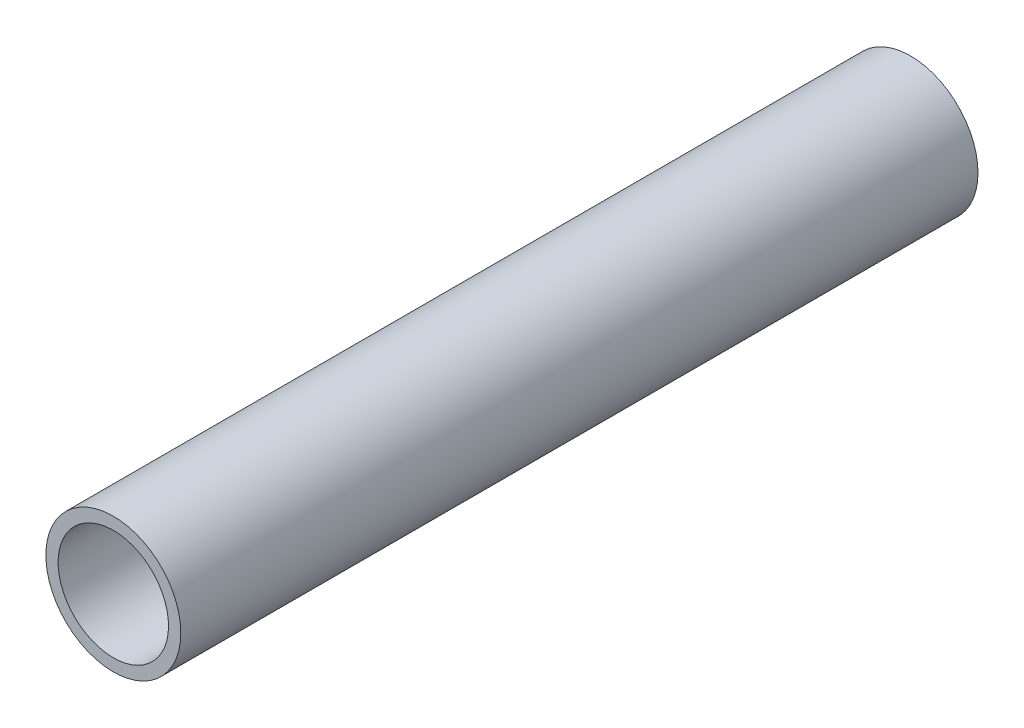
ISO-10303-21;
HEADER;
FILE_DESCRIPTION(('STEP AP214'),'2;1');
FILE_NAME('part.step','',(''),(''),'','','');
FILE_SCHEMA(('AUTOMOTIVE_DESIGN { 1 0 10303 214 1 1 1 1 }'));
ENDSEC;
DATA;
#1=APPLICATION_CONTEXT('core data for automotive mechanical design processes');
#2=APPLICATION_PROTOCOL_DEFINITION('international standard','automotive_design',2000,#1);
#3=PRODUCT_CONTEXT('',#1,'mechanical');
#4=PRODUCT('Part','Part','',(#3));
#5=PRODUCT_RELATED_PRODUCT_CATEGORY('part','',(#4));
#6=PRODUCT_DEFINITION_FORMATION('','',#4);
#7=PRODUCT_DEFINITION_CONTEXT('part definition',#1,'design');
#8=PRODUCT_DEFINITION('design','',#6,#7);
#9=PRODUCT_DEFINITION_SHAPE('','',#8);
#10=(LENGTH_UNIT() NAMED_UNIT(*) SI_UNIT(.MILLI.,.METRE.));
#11=(NAMED_UNIT(*) PLANE_ANGLE_UNIT() SI_UNIT($,.RADIAN.));
#12=(NAMED_UNIT(*) SI_UNIT($,.STERADIAN.) SOLID_ANGLE_UNIT());
#13=UNCERTAINTY_MEASURE_WITH_UNIT(LENGTH_MEASURE(1.E-05),#10,'distance_accuracy_value','');
#14=(GEOMETRIC_REPRESENTATION_CONTEXT(3) GLOBAL_UNCERTAINTY_ASSIGNED_CONTEXT((#13)) GLOBAL_UNIT_ASSIGNED_CONTEXT((#10,
#11,#12)) REPRESENTATION_CONTEXT('',''));
#15=CARTESIAN_POINT('',(0.,0.,0.));
#16=DIRECTION('',(0.,0.,1.));
#17=DIRECTION('',(1.,0.,0.));
#18=AXIS2_PLACEMENT_3D('',#15,#16,#17);
#19=CARTESIAN_POINT('',(0.,0.,130.));
#20=DIRECTION('',(0.,0.,1.));
#21=DIRECTION('',(1.,0.,0.));
#22=AXIS2_PLACEMENT_3D('',#19,#20,#21);
#23=PLANE('',#22);
#24=CARTESIAN_POINT('',(0.,0.,130.));
#25=DIRECTION('',(0.,0.,1.));
#26=DIRECTION('',(1.,0.,0.));
#27=AXIS2_PLACEMENT_3D('',#24,#25,#26);
#28=CIRCLE('',#27,11.);
#29=CARTESIAN_POINT('',(11.,0.,130.));
#30=VERTEX_POINT('',#29);
#31=EDGE_CURVE('E10',#30,#30,#28,.T.);
#32=ORIENTED_EDGE('',*,*,#31,.T.);
#33=EDGE_LOOP('',(#32));
#34=FACE_BOUND('',#33,.T.);
#35=CARTESIAN_POINT('',(0.,0.,130.));
#36=DIRECTION('',(0.,0.,1.));
#37=DIRECTION('',(1.,0.,0.));
#38=AXIS2_PLACEMENT_3D('',#35,#36,#37);
#39=CIRCLE('',#38,9.);
#40=CARTESIAN_POINT('',(9.,0.,130.));
#41=VERTEX_POINT('',#40);
#42=EDGE_CURVE('E42',#41,#41,#39,.T.);
#43=ORIENTED_EDGE('',*,*,#42,.F.);
#44=EDGE_LOOP('',(#43));
#45=FACE_BOUND('',#44,.T.);
#46=ADVANCED_FACE('F31',(#34,#45),#23,.T.);
#47=CARTESIAN_POINT('',(0.,0.,0.));
#48=DIRECTION('',(0.,0.,1.));
#49=DIRECTION('',(1.,0.,0.));
#50=AXIS2_PLACEMENT_3D('',#47,#48,#49);
#51=PLANE('',#50);
#52=CARTESIAN_POINT('',(0.,0.,0.));
#53=DIRECTION('',(0.,0.,1.));
#54=DIRECTION('',(1.,0.,0.));
#55=AXIS2_PLACEMENT_3D('',#52,#53,#54);
#56=CIRCLE('',#55,11.);
#57=CARTESIAN_POINT('',(11.,0.,0.));
#58=VERTEX_POINT('',#57);
#59=EDGE_CURVE('E35',#58,#58,#56,.T.);
#60=ORIENTED_EDGE('',*,*,#59,.F.);
#61=EDGE_LOOP('',(#60));
#62=FACE_BOUND('',#61,.T.);
#63=CARTESIAN_POINT('',(0.,0.,0.));
#64=DIRECTION('',(0.,0.,1.));
#65=DIRECTION('',(1.,0.,0.));
#66=AXIS2_PLACEMENT_3D('',#63,#64,#65);
#67=CIRCLE('',#66,9.);
#68=CARTESIAN_POINT('',(9.,0.,0.));
#69=VERTEX_POINT('',#68);
#70=EDGE_CURVE('E44',#69,#69,#67,.T.);
#71=ORIENTED_EDGE('',*,*,#70,.T.);
#72=EDGE_LOOP('',(#71));
#73=FACE_BOUND('',#72,.T.);
#74=ADVANCED_FACE('F54',(#62,#73),#51,.F.);
#75=CARTESIAN_POINT('',(0.,0.,130.));
#76=DIRECTION('',(0.,0.,-1.));
#77=DIRECTION('',(-1.,0.,0.));
#78=AXIS2_PLACEMENT_3D('',#75,#76,#77);
#79=CYLINDRICAL_SURFACE('',#78,11.);
#80=ORIENTED_EDGE('',*,*,#31,.F.);
#81=EDGE_LOOP('',(#80));
#82=FACE_BOUND('',#81,.T.);
#83=ORIENTED_EDGE('',*,*,#59,.T.);
#84=EDGE_LOOP('',(#83));
#85=FACE_BOUND('',#84,.T.);
#86=ADVANCED_FACE('F33',(#82,#85),#79,.T.);
#87=CARTESIAN_POINT('',(0.,0.,130.));
#88=DIRECTION('',(0.,0.,-1.));
#89=DIRECTION('',(-1.,0.,0.));
#90=AXIS2_PLACEMENT_3D('',#87,#88,#89);
#91=CYLINDRICAL_SURFACE('',#90,9.);
#92=ORIENTED_EDGE('',*,*,#42,.T.);
#93=EDGE_LOOP('',(#92));
#94=FACE_BOUND('',#93,.T.);
#95=ORIENTED_EDGE('',*,*,#70,.F.);
#96=EDGE_LOOP('',(#95));
#97=FACE_BOUND('',#96,.T.);
#98=ADVANCED_FACE('F50',(#94,#97),#91,.F.);
#99=CLOSED_SHELL('',(#46,#74,#86,#98));
#100=MANIFOLD_SOLID_BREP('B2',#99);
#101=ADVANCED_BREP_SHAPE_REPRESENTATION('',(#18,#100),#14);
#102=SHAPE_DEFINITION_REPRESENTATION(#9,#101);
ENDSEC;
END-ISO-10303-21;
